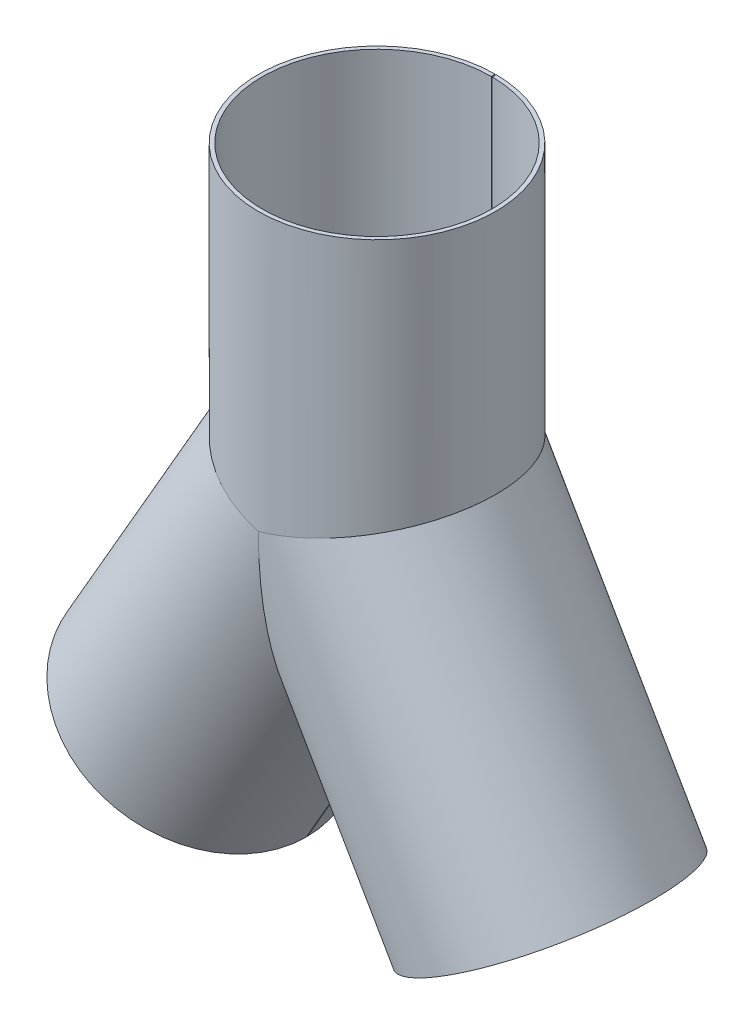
ISO-10303-21;
HEADER;
FILE_DESCRIPTION(('STEP AP214'),'2;1');
FILE_NAME('part.step','',(''),(''),'','','');
FILE_SCHEMA(('AUTOMOTIVE_DESIGN { 1 0 10303 214 1 1 1 1 }'));
ENDSEC;
DATA;
#1=APPLICATION_CONTEXT('core data for automotive mechanical design processes');
#2=APPLICATION_PROTOCOL_DEFINITION('international standard','automotive_design',2000,#1);
#3=PRODUCT_CONTEXT('',#1,'mechanical');
#4=PRODUCT('Part','Part','',(#3));
#5=PRODUCT_RELATED_PRODUCT_CATEGORY('part','',(#4));
#6=PRODUCT_DEFINITION_FORMATION('','',#4);
#7=PRODUCT_DEFINITION_CONTEXT('part definition',#1,'design');
#8=PRODUCT_DEFINITION('design','',#6,#7);
#9=PRODUCT_DEFINITION_SHAPE('','',#8);
#10=(LENGTH_UNIT() NAMED_UNIT(*) SI_UNIT(.MILLI.,.METRE.));
#11=(NAMED_UNIT(*) PLANE_ANGLE_UNIT() SI_UNIT($,.RADIAN.));
#12=(NAMED_UNIT(*) SI_UNIT($,.STERADIAN.) SOLID_ANGLE_UNIT());
#13=UNCERTAINTY_MEASURE_WITH_UNIT(LENGTH_MEASURE(1.E-05),#10,'distance_accuracy_value','');
#14=(GEOMETRIC_REPRESENTATION_CONTEXT(3) GLOBAL_UNCERTAINTY_ASSIGNED_CONTEXT((#13)) GLOBAL_UNIT_ASSIGNED_CONTEXT((#10,
#11,#12)) REPRESENTATION_CONTEXT('',''));
#15=CARTESIAN_POINT('',(0.,0.,0.));
#16=DIRECTION('',(0.,0.,1.));
#17=DIRECTION('',(1.,0.,0.));
#18=AXIS2_PLACEMENT_3D('',#15,#16,#17);
#19=CARTESIAN_POINT('',(1.11022302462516E-13,0.,0.));
#20=DIRECTION('',(-0.500000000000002,-0.866025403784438,0.));
#21=DIRECTION('',(-0.866025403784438,0.500000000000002,0.));
#22=AXIS2_PLACEMENT_3D('',#19,#20,#21);
#23=CYLINDRICAL_SURFACE('',#22,119.999999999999);
#24=DIRECTION('',(-0.500000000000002,-0.866025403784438,0.));
#25=VECTOR('',#24,1.);
#26=CARTESIAN_POINT('',(103.922146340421,-59.999479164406,0.5));
#27=LINE('',#26,#25);
#28=CARTESIAN_POINT('',(-71.0778536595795,-363.108370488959,0.5));
#29=VERTEX_POINT('',#28);
#30=CARTESIAN_POINT('',(0.,-239.997916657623,0.499999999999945));
#31=VERTEX_POINT('',#30);
#32=EDGE_CURVE('E130',#29,#31,#27,.F.);
#33=ORIENTED_EDGE('',*,*,#32,.T.);
#34=CARTESIAN_POINT('',(0.,-2.29785513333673E-13,0.));
#35=DIRECTION('',(1.,0.,0.));
#36=DIRECTION('',(0.,-1.,0.));
#37=AXIS2_PLACEMENT_3D('',#34,#35,#36);
#38=ELLIPSE('',#37,239.999999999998,119.999999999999);
#39=CARTESIAN_POINT('',(3.43202217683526E-13,-1.34049136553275E-13,120.));
#40=VERTEX_POINT('',#39);
#41=EDGE_CURVE('E136',#31,#40,#38,.F.);
#42=ORIENTED_EDGE('',*,*,#41,.T.);
#43=CARTESIAN_POINT('',(0.,0.,0.));
#44=DIRECTION('',(0.258819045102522,0.965925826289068,0.));
#45=DIRECTION('',(-0.965925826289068,0.258819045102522,0.));
#46=AXIS2_PLACEMENT_3D('',#43,#44,#45);
#47=ELLIPSE('',#46,124.233141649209,119.999999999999);
#48=CARTESIAN_POINT('',(3.43202217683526E-13,-1.34049136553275E-13,-120.));
#49=VERTEX_POINT('',#48);
#50=EDGE_CURVE('E119',#40,#49,#47,.F.);
#51=ORIENTED_EDGE('',*,*,#50,.T.);
#52=CARTESIAN_POINT('',(0.,-239.997916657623,-0.499999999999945));
#53=VERTEX_POINT('',#52);
#54=EDGE_CURVE('E137',#49,#53,#38,.F.);
#55=ORIENTED_EDGE('',*,*,#54,.T.);
#56=DIRECTION('',(-0.500000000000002,-0.866025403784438,0.));
#57=VECTOR('',#56,1.);
#58=CARTESIAN_POINT('',(103.922146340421,-59.999479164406,-0.5));
#59=LINE('',#58,#57);
#60=CARTESIAN_POINT('',(-71.0778536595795,-363.108370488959,-0.5));
#61=VERTEX_POINT('',#60);
#62=EDGE_CURVE('E109',#61,#53,#59,.F.);
#63=ORIENTED_EDGE('',*,*,#62,.F.);
#64=CARTESIAN_POINT('',(-175.000000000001,-303.108891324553,0.));
#65=DIRECTION('',(0.500000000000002,0.866025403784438,0.));
#66=DIRECTION('',(-0.866025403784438,0.500000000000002,0.));
#67=AXIS2_PLACEMENT_3D('',#64,#65,#66);
#68=CIRCLE('',#67,119.999999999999);
#69=EDGE_CURVE('E118',#61,#29,#68,.T.);
#70=ORIENTED_EDGE('',*,*,#69,.T.);
#71=EDGE_LOOP('',(#33,#42,#51,#55,#63,#70));
#72=FACE_BOUND('',#71,.T.);
#73=ADVANCED_FACE('F53',(#72),#23,.T.);
#74=CARTESIAN_POINT('',(0.,280.,1142.41549127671));
#75=DIRECTION('',(-1.,0.,0.));
#76=DIRECTION('',(0.,1.,0.));
#77=AXIS2_PLACEMENT_3D('',#74,#75,#76);
#78=PLANE('',#77);
#79=DIRECTION('',(0.,-1.,0.));
#80=VECTOR('',#79,1.);
#81=CARTESIAN_POINT('',(0.,280.,-0.499999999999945));
#82=LINE('',#81,#80);
#83=CARTESIAN_POINT('',(0.,-231.997844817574,-0.499999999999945));
#84=VERTEX_POINT('',#83);
#85=EDGE_CURVE('E60',#84,#53,#82,.T.);
#86=ORIENTED_EDGE('',*,*,#85,.T.);
#87=ORIENTED_EDGE('',*,*,#54,.F.);
#88=DIRECTION('',(0.,0.,-1.));
#89=VECTOR('',#88,1.);
#90=CARTESIAN_POINT('',(3.43202217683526E-13,-1.34049136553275E-13,0.));
#91=LINE('',#90,#89);
#92=CARTESIAN_POINT('',(3.43202217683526E-13,-1.34049136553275E-13,-115.999999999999));
#93=VERTEX_POINT('',#92);
#94=EDGE_CURVE('E140',#93,#49,#91,.T.);
#95=ORIENTED_EDGE('',*,*,#94,.F.);
#96=CARTESIAN_POINT('',(0.,-2.29785513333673E-13,0.));
#97=DIRECTION('',(1.,0.,0.));
#98=DIRECTION('',(0.,-1.,0.));
#99=AXIS2_PLACEMENT_3D('',#96,#97,#98);
#100=ELLIPSE('',#99,231.999999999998,115.999999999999);
#101=EDGE_CURVE('E134',#93,#84,#100,.F.);
#102=ORIENTED_EDGE('',*,*,#101,.T.);
#103=EDGE_LOOP('',(#86,#87,#95,#102));
#104=FACE_BOUND('',#103,.T.);
#105=ADVANCED_FACE('F149',(#104),#78,.F.);
#106=CARTESIAN_POINT('',(-175.000000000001,-303.108891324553,0.));
#107=DIRECTION('',(-0.500000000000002,-0.866025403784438,0.));
#108=DIRECTION('',(-0.866025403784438,0.500000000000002,0.));
#109=AXIS2_PLACEMENT_3D('',#106,#107,#108);
#110=PLANE('',#109);
#111=DIRECTION('',(-0.866025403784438,0.500000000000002,0.));
#112=VECTOR('',#111,1.);
#113=CARTESIAN_POINT('',(-175.000000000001,-303.108891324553,0.5));
#114=LINE('',#113,#112);
#115=CARTESIAN_POINT('',(-74.5419863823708,-361.108352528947,0.5));
#116=VERTEX_POINT('',#115);
#117=EDGE_CURVE('E124',#116,#29,#114,.F.);
#118=ORIENTED_EDGE('',*,*,#117,.T.);
#119=ORIENTED_EDGE('',*,*,#69,.F.);
#120=DIRECTION('',(-0.866025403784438,0.500000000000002,0.));
#121=VECTOR('',#120,1.);
#122=CARTESIAN_POINT('',(-175.000000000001,-303.108891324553,-0.5));
#123=LINE('',#122,#121);
#124=CARTESIAN_POINT('',(-74.5419863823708,-361.108352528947,-0.5));
#125=VERTEX_POINT('',#124);
#126=EDGE_CURVE('E107',#125,#61,#123,.F.);
#127=ORIENTED_EDGE('',*,*,#126,.F.);
#128=CARTESIAN_POINT('',(-175.000000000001,-303.108891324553,0.));
#129=DIRECTION('',(0.500000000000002,0.866025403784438,0.));
#130=DIRECTION('',(-0.866025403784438,0.500000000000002,0.));
#131=AXIS2_PLACEMENT_3D('',#128,#129,#130);
#132=CIRCLE('',#131,115.999999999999);
#133=EDGE_CURVE('E112',#125,#116,#132,.T.);
#134=ORIENTED_EDGE('',*,*,#133,.T.);
#135=EDGE_LOOP('',(#118,#119,#127,#134));
#136=FACE_BOUND('',#135,.T.);
#137=ADVANCED_FACE('F121',(#136),#110,.T.);
#138=CARTESIAN_POINT('',(1.11022302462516E-13,0.,0.));
#139=DIRECTION('',(-0.500000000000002,-0.866025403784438,0.));
#140=DIRECTION('',(-0.866025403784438,0.500000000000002,0.));
#141=AXIS2_PLACEMENT_3D('',#138,#139,#140);
#142=CYLINDRICAL_SURFACE('',#141,115.999999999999);
#143=ORIENTED_EDGE('',*,*,#133,.F.);
#144=DIRECTION('',(-0.500000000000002,-0.866025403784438,0.));
#145=VECTOR('',#144,1.);
#146=CARTESIAN_POINT('',(100.45801361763,-57.9994612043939,-0.5));
#147=LINE('',#146,#145);
#148=EDGE_CURVE('E67',#125,#84,#147,.F.);
#149=ORIENTED_EDGE('',*,*,#148,.T.);
#150=ORIENTED_EDGE('',*,*,#101,.F.);
#151=CARTESIAN_POINT('',(0.,0.,0.));
#152=DIRECTION('',(0.258819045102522,0.965925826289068,0.));
#153=DIRECTION('',(-0.965925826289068,0.258819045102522,0.));
#154=AXIS2_PLACEMENT_3D('',#151,#152,#153);
#155=ELLIPSE('',#154,120.092036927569,115.999999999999);
#156=CARTESIAN_POINT('',(0.,0.,116.));
#157=VERTEX_POINT('',#156);
#158=EDGE_CURVE('E146',#157,#93,#155,.F.);
#159=ORIENTED_EDGE('',*,*,#158,.F.);
#160=CARTESIAN_POINT('',(0.,-231.997844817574,0.499999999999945));
#161=VERTEX_POINT('',#160);
#162=EDGE_CURVE('E133',#161,#157,#100,.F.);
#163=ORIENTED_EDGE('',*,*,#162,.F.);
#164=DIRECTION('',(-0.500000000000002,-0.866025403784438,0.));
#165=VECTOR('',#164,1.);
#166=CARTESIAN_POINT('',(100.45801361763,-57.9994612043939,0.5));
#167=LINE('',#166,#165);
#168=EDGE_CURVE('E115',#116,#161,#167,.F.);
#169=ORIENTED_EDGE('',*,*,#168,.F.);
#170=EDGE_LOOP('',(#143,#149,#150,#159,#163,#169));
#171=FACE_BOUND('',#170,.T.);
#172=ADVANCED_FACE('F113',(#171),#142,.F.);
#173=CARTESIAN_POINT('',(-278.923048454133,74.737205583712,1142.41549127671));
#174=DIRECTION('',(-0.258819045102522,-0.965925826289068,0.));
#175=DIRECTION('',(-0.965925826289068,0.258819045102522,0.));
#176=AXIS2_PLACEMENT_3D('',#173,#174,#175);
#177=PLANE('',#176);
#178=EDGE_CURVE('E142',#40,#157,#91,.T.);
#179=ORIENTED_EDGE('',*,*,#178,.T.);
#180=ORIENTED_EDGE('',*,*,#158,.T.);
#181=ORIENTED_EDGE('',*,*,#94,.T.);
#182=ORIENTED_EDGE('',*,*,#50,.F.);
#183=EDGE_LOOP('',(#179,#180,#181,#182));
#184=FACE_BOUND('',#183,.T.);
#185=ADVANCED_FACE('F155',(#184),#177,.F.);
#186=ORIENTED_EDGE('',*,*,#162,.T.);
#187=ORIENTED_EDGE('',*,*,#178,.F.);
#188=ORIENTED_EDGE('',*,*,#41,.F.);
#189=DIRECTION('',(0.,-1.,0.));
#190=VECTOR('',#189,1.);
#191=CARTESIAN_POINT('',(0.,280.,0.499999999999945));
#192=LINE('',#191,#190);
#193=EDGE_CURVE('E13',#161,#31,#192,.T.);
#194=ORIENTED_EDGE('',*,*,#193,.F.);
#195=EDGE_LOOP('',(#186,#187,#188,#194));
#196=FACE_BOUND('',#195,.T.);
#197=ADVANCED_FACE('F159',(#196),#78,.F.);
#198=CARTESIAN_POINT('',(151.243556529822,261.961524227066,-0.5));
#199=DIRECTION('',(0.,0.,1.));
#200=DIRECTION('',(-1.,0.,0.));
#201=AXIS2_PLACEMENT_3D('',#198,#199,#200);
#202=PLANE('',#201);
#203=ORIENTED_EDGE('',*,*,#126,.T.);
#204=ORIENTED_EDGE('',*,*,#62,.T.);
#205=ORIENTED_EDGE('',*,*,#85,.F.);
#206=ORIENTED_EDGE('',*,*,#148,.F.);
#207=EDGE_LOOP('',(#203,#204,#205,#206));
#208=FACE_BOUND('',#207,.T.);
#209=ADVANCED_FACE('F104',(#208),#202,.T.);
#210=CARTESIAN_POINT('',(151.243556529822,261.961524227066,0.5));
#211=DIRECTION('',(0.,0.,1.));
#212=DIRECTION('',(-1.,0.,0.));
#213=AXIS2_PLACEMENT_3D('',#210,#211,#212);
#214=PLANE('',#213);
#215=ORIENTED_EDGE('',*,*,#32,.F.);
#216=ORIENTED_EDGE('',*,*,#117,.F.);
#217=ORIENTED_EDGE('',*,*,#168,.T.);
#218=ORIENTED_EDGE('',*,*,#193,.T.);
#219=EDGE_LOOP('',(#215,#216,#217,#218));
#220=FACE_BOUND('',#219,.T.);
#221=ADVANCED_FACE('F160',(#220),#214,.F.);
#222=CLOSED_SHELL('',(#73,#105,#137,#172,#185,#197,#209,#221));
#223=MANIFOLD_SOLID_BREP('B2',#222);
#224=CARTESIAN_POINT('',(-1.11022302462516E-13,0.,0.));
#225=DIRECTION('',(0.500000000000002,-0.866025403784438,0.));
#226=DIRECTION('',(0.866025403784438,0.500000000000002,0.));
#227=AXIS2_PLACEMENT_3D('',#224,#225,#226);
#228=CYLINDRICAL_SURFACE('',#227,119.999999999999);
#229=DIRECTION('',(0.500000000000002,-0.866025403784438,0.));
#230=VECTOR('',#229,1.);
#231=CARTESIAN_POINT('',(-103.922146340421,-59.999479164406,0.5));
#232=LINE('',#231,#230);
#233=CARTESIAN_POINT('',(71.0778536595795,-363.108370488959,0.5));
#234=VERTEX_POINT('',#233);
#235=CARTESIAN_POINT('',(0.,-239.997916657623,0.499999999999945));
#236=VERTEX_POINT('',#235);
#237=EDGE_CURVE('E255',#234,#236,#232,.F.);
#238=ORIENTED_EDGE('',*,*,#237,.F.);
#239=CARTESIAN_POINT('',(175.000000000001,-303.108891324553,0.));
#240=DIRECTION('',(0.500000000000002,-0.866025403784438,0.));
#241=DIRECTION('',(0.866025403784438,0.500000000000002,0.));
#242=AXIS2_PLACEMENT_3D('',#239,#240,#241);
#243=CIRCLE('',#242,119.999999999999);
#244=CARTESIAN_POINT('',(71.0778536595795,-363.108370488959,-0.5));
#245=VERTEX_POINT('',#244);
#246=EDGE_CURVE('E304',#245,#234,#243,.T.);
#247=ORIENTED_EDGE('',*,*,#246,.F.);
#248=DIRECTION('',(0.500000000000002,-0.866025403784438,0.));
#249=VECTOR('',#248,1.);
#250=CARTESIAN_POINT('',(-103.922146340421,-59.999479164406,-0.5));
#251=LINE('',#250,#249);
#252=CARTESIAN_POINT('',(0.,-239.997916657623,-0.499999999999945));
#253=VERTEX_POINT('',#252);
#254=EDGE_CURVE('E285',#245,#253,#251,.F.);
#255=ORIENTED_EDGE('',*,*,#254,.T.);
#256=CARTESIAN_POINT('',(0.,-2.29785513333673E-13,0.));
#257=DIRECTION('',(1.,0.,0.));
#258=DIRECTION('',(0.,-1.,0.));
#259=AXIS2_PLACEMENT_3D('',#256,#257,#258);
#260=ELLIPSE('',#259,239.999999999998,119.999999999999);
#261=CARTESIAN_POINT('',(-3.43202217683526E-13,-1.34049136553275E-13,-120.));
#262=VERTEX_POINT('',#261);
#263=EDGE_CURVE('E318',#262,#253,#260,.F.);
#264=ORIENTED_EDGE('',*,*,#263,.F.);
#265=CARTESIAN_POINT('',(0.,0.,0.));
#266=DIRECTION('',(0.258819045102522,-0.965925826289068,0.));
#267=DIRECTION('',(0.965925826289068,0.258819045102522,0.));
#268=AXIS2_PLACEMENT_3D('',#265,#266,#267);
#269=ELLIPSE('',#268,124.233141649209,119.999999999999);
#270=CARTESIAN_POINT('',(-3.43202217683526E-13,-1.34049136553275E-13,120.));
#271=VERTEX_POINT('',#270);
#272=EDGE_CURVE('E305',#271,#262,#269,.F.);
#273=ORIENTED_EDGE('',*,*,#272,.F.);
#274=EDGE_CURVE('E324',#236,#271,#260,.F.);
#275=ORIENTED_EDGE('',*,*,#274,.F.);
#276=EDGE_LOOP('',(#238,#247,#255,#264,#273,#275));
#277=FACE_BOUND('',#276,.T.);
#278=ADVANCED_FACE('F233',(#277),#228,.T.);
#279=CARTESIAN_POINT('',(0.,280.,1142.41549127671));
#280=DIRECTION('',(1.,0.,0.));
#281=DIRECTION('',(0.,1.,0.));
#282=AXIS2_PLACEMENT_3D('',#279,#280,#281);
#283=PLANE('',#282);
#284=DIRECTION('',(0.,-1.,0.));
#285=VECTOR('',#284,1.);
#286=CARTESIAN_POINT('',(0.,280.,-0.499999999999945));
#287=LINE('',#286,#285);
#288=CARTESIAN_POINT('',(0.,-231.997844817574,-0.499999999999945));
#289=VERTEX_POINT('',#288);
#290=EDGE_CURVE('E240',#289,#253,#287,.T.);
#291=ORIENTED_EDGE('',*,*,#290,.F.);
#292=CARTESIAN_POINT('',(0.,-2.29785513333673E-13,0.));
#293=DIRECTION('',(1.,0.,0.));
#294=DIRECTION('',(0.,-1.,0.));
#295=AXIS2_PLACEMENT_3D('',#292,#293,#294);
#296=ELLIPSE('',#295,231.999999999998,115.999999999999);
#297=CARTESIAN_POINT('',(-3.43202217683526E-13,-1.34049136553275E-13,-115.999999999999));
#298=VERTEX_POINT('',#297);
#299=EDGE_CURVE('E300',#298,#289,#296,.F.);
#300=ORIENTED_EDGE('',*,*,#299,.F.);
#301=DIRECTION('',(0.,0.,-1.));
#302=VECTOR('',#301,1.);
#303=CARTESIAN_POINT('',(-3.43202217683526E-13,-1.34049136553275E-13,0.));
#304=LINE('',#303,#302);
#305=EDGE_CURVE('E323',#298,#262,#304,.T.);
#306=ORIENTED_EDGE('',*,*,#305,.T.);
#307=ORIENTED_EDGE('',*,*,#263,.T.);
#308=EDGE_LOOP('',(#291,#300,#306,#307));
#309=FACE_BOUND('',#308,.T.);
#310=ADVANCED_FACE('F322',(#309),#283,.F.);
#311=CARTESIAN_POINT('',(175.000000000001,-303.108891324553,0.));
#312=DIRECTION('',(0.500000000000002,-0.866025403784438,0.));
#313=DIRECTION('',(0.866025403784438,0.500000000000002,0.));
#314=AXIS2_PLACEMENT_3D('',#311,#312,#313);
#315=PLANE('',#314);
#316=DIRECTION('',(0.866025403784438,0.500000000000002,0.));
#317=VECTOR('',#316,1.);
#318=CARTESIAN_POINT('',(175.000000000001,-303.108891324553,0.5));
#319=LINE('',#318,#317);
#320=CARTESIAN_POINT('',(74.5419863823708,-361.108352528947,0.5));
#321=VERTEX_POINT('',#320);
#322=EDGE_CURVE('E290',#321,#234,#319,.F.);
#323=ORIENTED_EDGE('',*,*,#322,.F.);
#324=CARTESIAN_POINT('',(175.000000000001,-303.108891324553,0.));
#325=DIRECTION('',(0.500000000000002,-0.866025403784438,0.));
#326=DIRECTION('',(0.866025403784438,0.500000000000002,0.));
#327=AXIS2_PLACEMENT_3D('',#324,#325,#326);
#328=CIRCLE('',#327,115.999999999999);
#329=CARTESIAN_POINT('',(74.5419863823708,-361.108352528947,-0.5));
#330=VERTEX_POINT('',#329);
#331=EDGE_CURVE('E297',#330,#321,#328,.T.);
#332=ORIENTED_EDGE('',*,*,#331,.F.);
#333=DIRECTION('',(0.866025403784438,0.500000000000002,0.));
#334=VECTOR('',#333,1.);
#335=CARTESIAN_POINT('',(175.000000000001,-303.108891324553,-0.5));
#336=LINE('',#335,#334);
#337=EDGE_CURVE('E282',#330,#245,#336,.F.);
#338=ORIENTED_EDGE('',*,*,#337,.T.);
#339=ORIENTED_EDGE('',*,*,#246,.T.);
#340=EDGE_LOOP('',(#323,#332,#338,#339));
#341=FACE_BOUND('',#340,.T.);
#342=ADVANCED_FACE('F303',(#341),#315,.T.);
#343=CARTESIAN_POINT('',(-1.11022302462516E-13,0.,0.));
#344=DIRECTION('',(0.500000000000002,-0.866025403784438,0.));
#345=DIRECTION('',(0.866025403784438,0.500000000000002,0.));
#346=AXIS2_PLACEMENT_3D('',#343,#344,#345);
#347=CYLINDRICAL_SURFACE('',#346,115.999999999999);
#348=ORIENTED_EDGE('',*,*,#331,.T.);
#349=DIRECTION('',(0.500000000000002,-0.866025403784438,0.));
#350=VECTOR('',#349,1.);
#351=CARTESIAN_POINT('',(-100.45801361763,-57.9994612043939,0.5));
#352=LINE('',#351,#350);
#353=CARTESIAN_POINT('',(0.,-231.997844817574,0.499999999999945));
#354=VERTEX_POINT('',#353);
#355=EDGE_CURVE('E319',#321,#354,#352,.F.);
#356=ORIENTED_EDGE('',*,*,#355,.T.);
#357=CARTESIAN_POINT('',(0.,0.,116.));
#358=VERTEX_POINT('',#357);
#359=EDGE_CURVE('E328',#354,#358,#296,.F.);
#360=ORIENTED_EDGE('',*,*,#359,.T.);
#361=CARTESIAN_POINT('',(0.,0.,0.));
#362=DIRECTION('',(0.258819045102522,-0.965925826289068,0.));
#363=DIRECTION('',(0.965925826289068,0.258819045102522,0.));
#364=AXIS2_PLACEMENT_3D('',#361,#362,#363);
#365=ELLIPSE('',#364,120.092036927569,115.999999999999);
#366=EDGE_CURVE('E307',#358,#298,#365,.F.);
#367=ORIENTED_EDGE('',*,*,#366,.T.);
#368=ORIENTED_EDGE('',*,*,#299,.T.);
#369=DIRECTION('',(0.500000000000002,-0.866025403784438,0.));
#370=VECTOR('',#369,1.);
#371=CARTESIAN_POINT('',(-100.45801361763,-57.9994612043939,-0.5));
#372=LINE('',#371,#370);
#373=EDGE_CURVE('E247',#330,#289,#372,.F.);
#374=ORIENTED_EDGE('',*,*,#373,.F.);
#375=EDGE_LOOP('',(#348,#356,#360,#367,#368,#374));
#376=FACE_BOUND('',#375,.T.);
#377=ADVANCED_FACE('F295',(#376),#347,.F.);
#378=CARTESIAN_POINT('',(278.923048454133,74.737205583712,1142.41549127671));
#379=DIRECTION('',(0.258819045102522,-0.965925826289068,0.));
#380=DIRECTION('',(0.965925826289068,0.258819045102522,0.));
#381=AXIS2_PLACEMENT_3D('',#378,#379,#380);
#382=PLANE('',#381);
#383=EDGE_CURVE('E310',#271,#358,#304,.T.);
#384=ORIENTED_EDGE('',*,*,#383,.F.);
#385=ORIENTED_EDGE('',*,*,#272,.T.);
#386=ORIENTED_EDGE('',*,*,#305,.F.);
#387=ORIENTED_EDGE('',*,*,#366,.F.);
#388=EDGE_LOOP('',(#384,#385,#386,#387));
#389=FACE_BOUND('',#388,.T.);
#390=ADVANCED_FACE('F340',(#389),#382,.F.);
#391=ORIENTED_EDGE('',*,*,#359,.F.);
#392=DIRECTION('',(0.,-1.,0.));
#393=VECTOR('',#392,1.);
#394=CARTESIAN_POINT('',(0.,280.,0.499999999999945));
#395=LINE('',#394,#393);
#396=EDGE_CURVE('E51',#354,#236,#395,.T.);
#397=ORIENTED_EDGE('',*,*,#396,.T.);
#398=ORIENTED_EDGE('',*,*,#274,.T.);
#399=ORIENTED_EDGE('',*,*,#383,.T.);
#400=EDGE_LOOP('',(#391,#397,#398,#399));
#401=FACE_BOUND('',#400,.T.);
#402=ADVANCED_FACE('F337',(#401),#283,.F.);
#403=CARTESIAN_POINT('',(-151.243556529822,261.961524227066,-0.5));
#404=DIRECTION('',(0.,0.,1.));
#405=DIRECTION('',(1.,0.,0.));
#406=AXIS2_PLACEMENT_3D('',#403,#404,#405);
#407=PLANE('',#406);
#408=ORIENTED_EDGE('',*,*,#337,.F.);
#409=ORIENTED_EDGE('',*,*,#373,.T.);
#410=ORIENTED_EDGE('',*,*,#290,.T.);
#411=ORIENTED_EDGE('',*,*,#254,.F.);
#412=EDGE_LOOP('',(#408,#409,#410,#411));
#413=FACE_BOUND('',#412,.T.);
#414=ADVANCED_FACE('F283',(#413),#407,.T.);
#415=CARTESIAN_POINT('',(-151.243556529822,261.961524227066,0.5));
#416=DIRECTION('',(0.,0.,1.));
#417=DIRECTION('',(1.,0.,0.));
#418=AXIS2_PLACEMENT_3D('',#415,#416,#417);
#419=PLANE('',#418);
#420=ORIENTED_EDGE('',*,*,#237,.T.);
#421=ORIENTED_EDGE('',*,*,#396,.F.);
#422=ORIENTED_EDGE('',*,*,#355,.F.);
#423=ORIENTED_EDGE('',*,*,#322,.T.);
#424=EDGE_LOOP('',(#420,#421,#422,#423));
#425=FACE_BOUND('',#424,.T.);
#426=ADVANCED_FACE('F331',(#425),#419,.F.);
#427=CLOSED_SHELL('',(#278,#310,#342,#377,#390,#402,#414,#426));
#428=MANIFOLD_SOLID_BREP('B7',#427);
#429=CARTESIAN_POINT('',(0.,280.,0.));
#430=DIRECTION('',(0.,-1.,0.));
#431=DIRECTION('',(0.,0.,-1.));
#432=AXIS2_PLACEMENT_3D('',#429,#430,#431);
#433=CYLINDRICAL_SURFACE('',#432,120.);
#434=CARTESIAN_POINT('',(0.,280.,0.));
#435=DIRECTION('',(0.,1.,0.));
#436=DIRECTION('',(0.,0.,1.));
#437=AXIS2_PLACEMENT_3D('',#434,#435,#436);
#438=CIRCLE('',#437,120.);
#439=CARTESIAN_POINT('',(-0.500000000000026,280.,-119.998958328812));
#440=VERTEX_POINT('',#439);
#441=CARTESIAN_POINT('',(0.499999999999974,280.,-119.998958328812));
#442=VERTEX_POINT('',#441);
#443=EDGE_CURVE('E461',#440,#442,#438,.T.);
#444=ORIENTED_EDGE('',*,*,#443,.F.);
#445=DIRECTION('',(0.,-1.,0.));
#446=VECTOR('',#445,1.);
#447=CARTESIAN_POINT('',(-0.500000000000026,280.,-119.998958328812));
#448=LINE('',#447,#446);
#449=CARTESIAN_POINT('',(-0.5,0.133974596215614,-119.998958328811));
#450=VERTEX_POINT('',#449);
#451=EDGE_CURVE('E488',#440,#450,#448,.T.);
#452=ORIENTED_EDGE('',*,*,#451,.T.);
#453=CARTESIAN_POINT('',(0.,0.,0.));
#454=DIRECTION('',(0.258819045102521,0.965925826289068,0.));
#455=DIRECTION('',(0.965925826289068,-0.258819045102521,0.));
#456=AXIS2_PLACEMENT_3D('',#453,#454,#455);
#457=ELLIPSE('',#456,124.23314164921,120.);
#458=CARTESIAN_POINT('',(0.,0.,120.));
#459=VERTEX_POINT('',#458);
#460=EDGE_CURVE('E471',#450,#459,#457,.T.);
#461=ORIENTED_EDGE('',*,*,#460,.T.);
#462=CARTESIAN_POINT('',(0.,0.,0.));
#463=DIRECTION('',(0.258819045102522,-0.965925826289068,0.));
#464=DIRECTION('',(-0.965925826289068,-0.258819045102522,0.));
#465=AXIS2_PLACEMENT_3D('',#462,#463,#464);
#466=ELLIPSE('',#465,124.23314164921,120.);
#467=CARTESIAN_POINT('',(0.5,0.133974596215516,-119.998958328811));
#468=VERTEX_POINT('',#467);
#469=EDGE_CURVE('E463',#468,#459,#466,.T.);
#470=ORIENTED_EDGE('',*,*,#469,.F.);
#471=DIRECTION('',(0.,-1.,0.));
#472=VECTOR('',#471,1.);
#473=CARTESIAN_POINT('',(0.499999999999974,280.,-119.998958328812));
#474=LINE('',#473,#472);
#475=EDGE_CURVE('E425',#442,#468,#474,.T.);
#476=ORIENTED_EDGE('',*,*,#475,.F.);
#477=EDGE_LOOP('',(#444,#452,#461,#470,#476));
#478=FACE_BOUND('',#477,.T.);
#479=ADVANCED_FACE('F404',(#478),#433,.T.);
#480=CARTESIAN_POINT('',(278.923048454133,74.737205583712,1142.41549127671));
#481=DIRECTION('',(0.258819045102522,-0.965925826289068,0.));
#482=DIRECTION('',(0.965925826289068,0.258819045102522,0.));
#483=AXIS2_PLACEMENT_3D('',#480,#481,#482);
#484=PLANE('',#483);
#485=CARTESIAN_POINT('',(0.,0.,0.));
#486=DIRECTION('',(0.258819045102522,-0.965925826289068,0.));
#487=DIRECTION('',(-0.965925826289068,-0.258819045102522,0.));
#488=AXIS2_PLACEMENT_3D('',#485,#486,#487);
#489=ELLIPSE('',#488,120.09203692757,116.);
#490=CARTESIAN_POINT('',(0.5,0.133974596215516,-115.998922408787));
#491=VERTEX_POINT('',#490);
#492=CARTESIAN_POINT('',(0.,0.,116.));
#493=VERTEX_POINT('',#492);
#494=EDGE_CURVE('E480',#491,#493,#489,.T.);
#495=ORIENTED_EDGE('',*,*,#494,.F.);
#496=DIRECTION('',(0.,0.,-1.));
#497=VECTOR('',#496,1.);
#498=CARTESIAN_POINT('',(0.5,0.133974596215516,1142.41549127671));
#499=LINE('',#498,#497);
#500=EDGE_CURVE('E411',#491,#468,#499,.T.);
#501=ORIENTED_EDGE('',*,*,#500,.T.);
#502=ORIENTED_EDGE('',*,*,#469,.T.);
#503=DIRECTION('',(0.,0.,-1.));
#504=VECTOR('',#503,1.);
#505=CARTESIAN_POINT('',(1.6085896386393E-13,0.,0.));
#506=LINE('',#505,#504);
#507=EDGE_CURVE('E492',#459,#493,#506,.T.);
#508=ORIENTED_EDGE('',*,*,#507,.T.);
#509=EDGE_LOOP('',(#495,#501,#502,#508));
#510=FACE_BOUND('',#509,.T.);
#511=ADVANCED_FACE('F476',(#510),#484,.T.);
#512=CARTESIAN_POINT('',(0.,280.,0.));
#513=DIRECTION('',(0.,-1.,0.));
#514=DIRECTION('',(0.,0.,-1.));
#515=AXIS2_PLACEMENT_3D('',#512,#513,#514);
#516=CYLINDRICAL_SURFACE('',#515,116.);
#517=DIRECTION('',(0.,-1.,0.));
#518=VECTOR('',#517,1.);
#519=CARTESIAN_POINT('',(-0.500000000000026,280.,-115.998922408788));
#520=LINE('',#519,#518);
#521=CARTESIAN_POINT('',(-0.500000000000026,280.,-115.998922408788));
#522=VERTEX_POINT('',#521);
#523=CARTESIAN_POINT('',(-0.5,0.133974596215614,-115.998922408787));
#524=VERTEX_POINT('',#523);
#525=EDGE_CURVE('E418',#522,#524,#520,.T.);
#526=ORIENTED_EDGE('',*,*,#525,.F.);
#527=CARTESIAN_POINT('',(0.,280.,0.));
#528=DIRECTION('',(0.,1.,0.));
#529=DIRECTION('',(1.,0.,0.));
#530=AXIS2_PLACEMENT_3D('',#527,#528,#529);
#531=CIRCLE('',#530,116.);
#532=CARTESIAN_POINT('',(0.499999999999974,280.,-115.998922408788));
#533=VERTEX_POINT('',#532);
#534=EDGE_CURVE('E468',#522,#533,#531,.T.);
#535=ORIENTED_EDGE('',*,*,#534,.T.);
#536=DIRECTION('',(0.,-1.,0.));
#537=VECTOR('',#536,1.);
#538=CARTESIAN_POINT('',(0.499999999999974,280.,-115.998922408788));
#539=LINE('',#538,#537);
#540=EDGE_CURVE('E450',#533,#491,#539,.T.);
#541=ORIENTED_EDGE('',*,*,#540,.T.);
#542=ORIENTED_EDGE('',*,*,#494,.T.);
#543=CARTESIAN_POINT('',(0.,0.,0.));
#544=DIRECTION('',(0.258819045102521,0.965925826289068,0.));
#545=DIRECTION('',(0.965925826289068,-0.258819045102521,0.));
#546=AXIS2_PLACEMENT_3D('',#543,#544,#545);
#547=ELLIPSE('',#546,120.09203692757,116.);
#548=EDGE_CURVE('E467',#524,#493,#547,.T.);
#549=ORIENTED_EDGE('',*,*,#548,.F.);
#550=EDGE_LOOP('',(#526,#535,#541,#542,#549));
#551=FACE_BOUND('',#550,.T.);
#552=ADVANCED_FACE('F482',(#551),#516,.F.);
#553=CARTESIAN_POINT('',(0.,280.,0.));
#554=DIRECTION('',(0.,1.,0.));
#555=DIRECTION('',(0.,0.,1.));
#556=AXIS2_PLACEMENT_3D('',#553,#554,#555);
#557=PLANE('',#556);
#558=DIRECTION('',(0.,0.,1.));
#559=VECTOR('',#558,1.);
#560=CARTESIAN_POINT('',(-0.500000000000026,280.,-120.));
#561=LINE('',#560,#559);
#562=EDGE_CURVE('E455',#440,#522,#561,.T.);
#563=ORIENTED_EDGE('',*,*,#562,.F.);
#564=ORIENTED_EDGE('',*,*,#443,.T.);
#565=DIRECTION('',(0.,0.,1.));
#566=VECTOR('',#565,1.);
#567=CARTESIAN_POINT('',(0.499999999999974,280.,-120.));
#568=LINE('',#567,#566);
#569=EDGE_CURVE('E447',#442,#533,#568,.T.);
#570=ORIENTED_EDGE('',*,*,#569,.T.);
#571=ORIENTED_EDGE('',*,*,#534,.F.);
#572=EDGE_LOOP('',(#563,#564,#570,#571));
#573=FACE_BOUND('',#572,.T.);
#574=ADVANCED_FACE('F466',(#573),#557,.T.);
#575=CARTESIAN_POINT('',(-278.923048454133,74.737205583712,1142.41549127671));
#576=DIRECTION('',(0.258819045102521,0.965925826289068,0.));
#577=DIRECTION('',(-0.965925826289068,0.258819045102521,0.));
#578=AXIS2_PLACEMENT_3D('',#575,#576,#577);
#579=PLANE('',#578);
#580=ORIENTED_EDGE('',*,*,#460,.F.);
#581=DIRECTION('',(0.,0.,1.));
#582=VECTOR('',#581,1.);
#583=CARTESIAN_POINT('',(-0.5,0.133974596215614,1142.41549127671));
#584=LINE('',#583,#582);
#585=EDGE_CURVE('E231',#450,#524,#584,.T.);
#586=ORIENTED_EDGE('',*,*,#585,.T.);
#587=ORIENTED_EDGE('',*,*,#548,.T.);
#588=ORIENTED_EDGE('',*,*,#507,.F.);
#589=EDGE_LOOP('',(#580,#586,#587,#588));
#590=FACE_BOUND('',#589,.T.);
#591=ADVANCED_FACE('F495',(#590),#579,.F.);
#592=CARTESIAN_POINT('',(0.499999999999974,280.,-120.));
#593=DIRECTION('',(-1.,0.,0.));
#594=DIRECTION('',(0.,-1.,0.));
#595=AXIS2_PLACEMENT_3D('',#592,#593,#594);
#596=PLANE('',#595);
#597=ORIENTED_EDGE('',*,*,#475,.T.);
#598=ORIENTED_EDGE('',*,*,#500,.F.);
#599=ORIENTED_EDGE('',*,*,#540,.F.);
#600=ORIENTED_EDGE('',*,*,#569,.F.);
#601=EDGE_LOOP('',(#597,#598,#599,#600));
#602=FACE_BOUND('',#601,.T.);
#603=ADVANCED_FACE('F448',(#602),#596,.T.);
#604=CARTESIAN_POINT('',(-0.500000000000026,280.,-120.));
#605=DIRECTION('',(-1.,0.,0.));
#606=DIRECTION('',(0.,-1.,0.));
#607=AXIS2_PLACEMENT_3D('',#604,#605,#606);
#608=PLANE('',#607);
#609=ORIENTED_EDGE('',*,*,#562,.T.);
#610=ORIENTED_EDGE('',*,*,#525,.T.);
#611=ORIENTED_EDGE('',*,*,#585,.F.);
#612=ORIENTED_EDGE('',*,*,#451,.F.);
#613=EDGE_LOOP('',(#609,#610,#611,#612));
#614=FACE_BOUND('',#613,.T.);
#615=ADVANCED_FACE('F496',(#614),#608,.F.);
#616=CLOSED_SHELL('',(#479,#511,#552,#574,#591,#603,#615));
#617=MANIFOLD_SOLID_BREP('B45',#616);
#618=ADVANCED_BREP_SHAPE_REPRESENTATION('',(#18,#223,#428,#617),#14);
#619=SHAPE_DEFINITION_REPRESENTATION(#9,#618);
ENDSEC;
END-ISO-10303-21;
